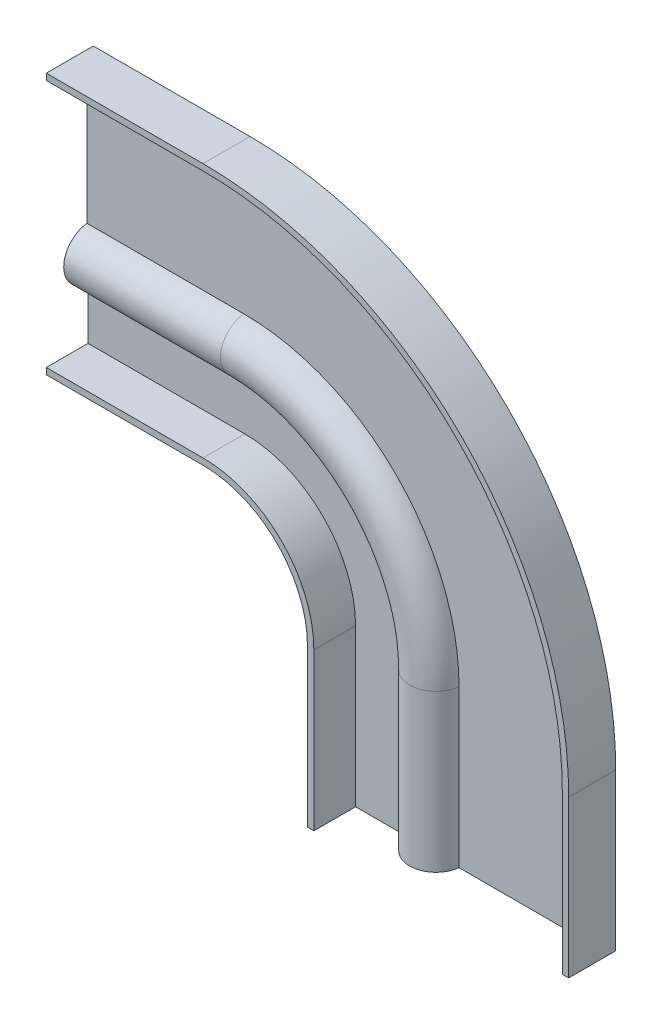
ISO-10303-21;
HEADER;
FILE_DESCRIPTION(('STEP AP214'),'2;1');
FILE_NAME('part.step','',(''),(''),'','','');
FILE_SCHEMA(('AUTOMOTIVE_DESIGN { 1 0 10303 214 1 1 1 1 }'));
ENDSEC;
DATA;
#1=APPLICATION_CONTEXT('core data for automotive mechanical design processes');
#2=APPLICATION_PROTOCOL_DEFINITION('international standard','automotive_design',2000,#1);
#3=PRODUCT_CONTEXT('',#1,'mechanical');
#4=PRODUCT('Part','Part','',(#3));
#5=PRODUCT_RELATED_PRODUCT_CATEGORY('part','',(#4));
#6=PRODUCT_DEFINITION_FORMATION('','',#4);
#7=PRODUCT_DEFINITION_CONTEXT('part definition',#1,'design');
#8=PRODUCT_DEFINITION('design','',#6,#7);
#9=PRODUCT_DEFINITION_SHAPE('','',#8);
#10=(LENGTH_UNIT() NAMED_UNIT(*) SI_UNIT(.MILLI.,.METRE.));
#11=(NAMED_UNIT(*) PLANE_ANGLE_UNIT() SI_UNIT($,.RADIAN.));
#12=(NAMED_UNIT(*) SI_UNIT($,.STERADIAN.) SOLID_ANGLE_UNIT());
#13=UNCERTAINTY_MEASURE_WITH_UNIT(LENGTH_MEASURE(1.E-05),#10,'distance_accuracy_value','');
#14=(GEOMETRIC_REPRESENTATION_CONTEXT(3) GLOBAL_UNCERTAINTY_ASSIGNED_CONTEXT((#13)) GLOBAL_UNIT_ASSIGNED_CONTEXT((#10,
#11,#12)) REPRESENTATION_CONTEXT('',''));
#15=CARTESIAN_POINT('',(0.,0.,0.));
#16=DIRECTION('',(0.,0.,1.));
#17=DIRECTION('',(1.,0.,0.));
#18=AXIS2_PLACEMENT_3D('',#15,#16,#17);
#19=CARTESIAN_POINT('',(66.214,-20.,0.617471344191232));
#20=DIRECTION('',(0.,-1.,0.));
#21=DIRECTION('',(1.,0.,0.));
#22=AXIS2_PLACEMENT_3D('',#19,#20,#21);
#23=CYLINDRICAL_SURFACE('',#22,3.83091872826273);
#24=CARTESIAN_POINT('',(66.214,-20.,0.617471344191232));
#25=DIRECTION('',(0.,1.,0.));
#26=DIRECTION('',(0.,0.,1.));
#27=AXIS2_PLACEMENT_3D('',#24,#25,#26);
#28=CIRCLE('',#27,3.83091872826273);
#29=CARTESIAN_POINT('',(62.4331710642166,-20.,0.));
#30=VERTEX_POINT('',#29);
#31=CARTESIAN_POINT('',(69.9948289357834,-20.,0.));
#32=VERTEX_POINT('',#31);
#33=EDGE_CURVE('E237',#30,#32,#28,.T.);
#34=ORIENTED_EDGE('',*,*,#33,.T.);
#35=DIRECTION('',(0.,-1.,0.));
#36=VECTOR('',#35,1.);
#37=CARTESIAN_POINT('',(69.9948289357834,-20.,0.));
#38=LINE('',#37,#36);
#39=CARTESIAN_POINT('',(69.9948289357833,-50.,0.));
#40=VERTEX_POINT('',#39);
#41=EDGE_CURVE('E327',#32,#40,#38,.T.);
#42=ORIENTED_EDGE('',*,*,#41,.T.);
#43=CARTESIAN_POINT('',(66.214,-50.,0.617471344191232));
#44=DIRECTION('',(0.,1.,0.));
#45=DIRECTION('',(0.,0.,1.));
#46=AXIS2_PLACEMENT_3D('',#43,#44,#45);
#47=CIRCLE('',#46,3.83091872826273);
#48=CARTESIAN_POINT('',(62.4331710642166,-50.,0.));
#49=VERTEX_POINT('',#48);
#50=EDGE_CURVE('E52',#49,#40,#47,.T.);
#51=ORIENTED_EDGE('',*,*,#50,.F.);
#52=DIRECTION('',(0.,-1.,0.));
#53=VECTOR('',#52,1.);
#54=CARTESIAN_POINT('',(62.4331710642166,-20.,0.));
#55=LINE('',#54,#53);
#56=EDGE_CURVE('E37',#30,#49,#55,.T.);
#57=ORIENTED_EDGE('',*,*,#56,.F.);
#58=EDGE_LOOP('',(#34,#42,#51,#57));
#59=FACE_BOUND('',#58,.T.);
#60=ADVANCED_FACE('F30',(#59),#23,.F.);
#61=CARTESIAN_POINT('',(100.,-20.,9.00000000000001));
#62=DIRECTION('',(1.,0.,0.));
#63=DIRECTION('',(0.,1.,0.));
#64=AXIS2_PLACEMENT_3D('',#61,#62,#63);
#65=PLANE('',#64);
#66=DIRECTION('',(0.,0.,1.));
#67=VECTOR('',#66,1.);
#68=CARTESIAN_POINT('',(100.,-20.,9.00000000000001));
#69=LINE('',#68,#67);
#70=CARTESIAN_POINT('',(100.,-20.,0.));
#71=VERTEX_POINT('',#70);
#72=CARTESIAN_POINT('',(100.,-20.,9.00000000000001));
#73=VERTEX_POINT('',#72);
#74=EDGE_CURVE('E234',#71,#73,#69,.T.);
#75=ORIENTED_EDGE('',*,*,#74,.T.);
#76=DIRECTION('',(0.,-1.,0.));
#77=VECTOR('',#76,1.);
#78=CARTESIAN_POINT('',(100.,-20.,9.00000000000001));
#79=LINE('',#78,#77);
#80=CARTESIAN_POINT('',(100.,-50.,9.00000000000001));
#81=VERTEX_POINT('',#80);
#82=EDGE_CURVE('E321',#73,#81,#79,.T.);
#83=ORIENTED_EDGE('',*,*,#82,.T.);
#84=DIRECTION('',(0.,0.,1.));
#85=VECTOR('',#84,1.);
#86=CARTESIAN_POINT('',(100.,-50.,9.00000000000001));
#87=LINE('',#86,#85);
#88=CARTESIAN_POINT('',(100.,-50.,0.));
#89=VERTEX_POINT('',#88);
#90=EDGE_CURVE('E292',#89,#81,#87,.T.);
#91=ORIENTED_EDGE('',*,*,#90,.F.);
#92=DIRECTION('',(0.,-1.,0.));
#93=VECTOR('',#92,1.);
#94=CARTESIAN_POINT('',(100.,-20.,0.));
#95=LINE('',#94,#93);
#96=EDGE_CURVE('E324',#71,#89,#95,.T.);
#97=ORIENTED_EDGE('',*,*,#96,.F.);
#98=EDGE_LOOP('',(#75,#83,#91,#97));
#99=FACE_BOUND('',#98,.T.);
#100=ADVANCED_FACE('F452',(#99),#65,.T.);
#101=CARTESIAN_POINT('',(98.786,-20.,9.00000000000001));
#102=DIRECTION('',(-1.,0.,0.));
#103=DIRECTION('',(0.,0.,1.));
#104=AXIS2_PLACEMENT_3D('',#101,#102,#103);
#105=PLANE('',#104);
#106=DIRECTION('',(0.,0.,-1.));
#107=VECTOR('',#106,1.);
#108=CARTESIAN_POINT('',(98.786,-20.,9.00000000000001));
#109=LINE('',#108,#107);
#110=CARTESIAN_POINT('',(98.786,-20.,9.00000000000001));
#111=VERTEX_POINT('',#110);
#112=CARTESIAN_POINT('',(98.786,-20.,1.214));
#113=VERTEX_POINT('',#112);
#114=EDGE_CURVE('E231',#111,#113,#109,.T.);
#115=ORIENTED_EDGE('',*,*,#114,.T.);
#116=DIRECTION('',(0.,-1.,0.));
#117=VECTOR('',#116,1.);
#118=CARTESIAN_POINT('',(98.786,-20.,1.214));
#119=LINE('',#118,#117);
#120=CARTESIAN_POINT('',(98.786,-50.,1.214));
#121=VERTEX_POINT('',#120);
#122=EDGE_CURVE('E315',#113,#121,#119,.T.);
#123=ORIENTED_EDGE('',*,*,#122,.T.);
#124=DIRECTION('',(0.,0.,-1.));
#125=VECTOR('',#124,1.);
#126=CARTESIAN_POINT('',(98.786,-50.,9.00000000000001));
#127=LINE('',#126,#125);
#128=CARTESIAN_POINT('',(98.786,-50.,9.00000000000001));
#129=VERTEX_POINT('',#128);
#130=EDGE_CURVE('E286',#129,#121,#127,.T.);
#131=ORIENTED_EDGE('',*,*,#130,.F.);
#132=DIRECTION('',(0.,-1.,0.));
#133=VECTOR('',#132,1.);
#134=CARTESIAN_POINT('',(98.786,-20.,9.00000000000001));
#135=LINE('',#134,#133);
#136=EDGE_CURVE('E318',#111,#129,#135,.T.);
#137=ORIENTED_EDGE('',*,*,#136,.F.);
#138=EDGE_LOOP('',(#115,#123,#131,#137));
#139=FACE_BOUND('',#138,.T.);
#140=ADVANCED_FACE('F455',(#139),#105,.T.);
#141=CARTESIAN_POINT('',(66.214,-20.,0.617471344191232));
#142=DIRECTION('',(0.,-1.,0.));
#143=DIRECTION('',(1.,0.,0.));
#144=AXIS2_PLACEMENT_3D('',#141,#142,#143);
#145=CYLINDRICAL_SURFACE('',#144,5.04491872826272);
#146=CARTESIAN_POINT('',(66.214,-20.,0.617471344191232));
#147=DIRECTION('',(0.,-1.,0.));
#148=DIRECTION('',(0.,0.,-1.));
#149=AXIS2_PLACEMENT_3D('',#146,#147,#148);
#150=CIRCLE('',#149,5.04491872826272);
#151=CARTESIAN_POINT('',(71.223526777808,-20.,1.214));
#152=VERTEX_POINT('',#151);
#153=CARTESIAN_POINT('',(61.1847097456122,-20.,1.01426412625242));
#154=VERTEX_POINT('',#153);
#155=EDGE_CURVE('E228',#152,#154,#150,.T.);
#156=ORIENTED_EDGE('',*,*,#155,.T.);
#157=DIRECTION('',(0.,-1.,0.));
#158=VECTOR('',#157,1.);
#159=CARTESIAN_POINT('',(61.1847097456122,-20.,1.01426412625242));
#160=LINE('',#159,#158);
#161=CARTESIAN_POINT('',(61.1847097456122,-50.,1.01426412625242));
#162=VERTEX_POINT('',#161);
#163=EDGE_CURVE('E309',#154,#162,#160,.T.);
#164=ORIENTED_EDGE('',*,*,#163,.T.);
#165=CARTESIAN_POINT('',(66.214,-50.,0.617471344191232));
#166=DIRECTION('',(0.,-1.,0.));
#167=DIRECTION('',(0.,0.,-1.));
#168=AXIS2_PLACEMENT_3D('',#165,#166,#167);
#169=CIRCLE('',#168,5.04491872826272);
#170=CARTESIAN_POINT('',(71.223526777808,-50.,1.214));
#171=VERTEX_POINT('',#170);
#172=EDGE_CURVE('E280',#171,#162,#169,.T.);
#173=ORIENTED_EDGE('',*,*,#172,.F.);
#174=DIRECTION('',(0.,-1.,0.));
#175=VECTOR('',#174,1.);
#176=CARTESIAN_POINT('',(71.223526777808,-20.,1.214));
#177=LINE('',#176,#175);
#178=EDGE_CURVE('E312',#152,#171,#177,.T.);
#179=ORIENTED_EDGE('',*,*,#178,.F.);
#180=EDGE_LOOP('',(#156,#164,#173,#179));
#181=FACE_BOUND('',#180,.T.);
#182=ADVANCED_FACE('F474',(#181),#145,.T.);
#183=CARTESIAN_POINT('',(51.214,-20.,1.01426412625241));
#184=DIRECTION('',(1.,0.,0.));
#185=DIRECTION('',(0.,1.,0.));
#186=AXIS2_PLACEMENT_3D('',#183,#184,#185);
#187=PLANE('',#186);
#188=DIRECTION('',(0.,0.,1.));
#189=VECTOR('',#188,1.);
#190=CARTESIAN_POINT('',(51.214,-20.,1.01426412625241));
#191=LINE('',#190,#189);
#192=CARTESIAN_POINT('',(51.214,-20.,1.01426412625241));
#193=VERTEX_POINT('',#192);
#194=CARTESIAN_POINT('',(51.214,-20.,9.));
#195=VERTEX_POINT('',#194);
#196=EDGE_CURVE('E219',#193,#195,#191,.T.);
#197=ORIENTED_EDGE('',*,*,#196,.T.);
#198=DIRECTION('',(0.,-1.,0.));
#199=VECTOR('',#198,1.);
#200=CARTESIAN_POINT('',(51.214,-20.,9.));
#201=LINE('',#200,#199);
#202=CARTESIAN_POINT('',(51.214,-50.,9.));
#203=VERTEX_POINT('',#202);
#204=EDGE_CURVE('E303',#195,#203,#201,.T.);
#205=ORIENTED_EDGE('',*,*,#204,.T.);
#206=DIRECTION('',(0.,0.,1.));
#207=VECTOR('',#206,1.);
#208=CARTESIAN_POINT('',(51.214,-50.,1.01426412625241));
#209=LINE('',#208,#207);
#210=CARTESIAN_POINT('',(51.214,-50.,1.01426412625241));
#211=VERTEX_POINT('',#210);
#212=EDGE_CURVE('E274',#211,#203,#209,.T.);
#213=ORIENTED_EDGE('',*,*,#212,.F.);
#214=DIRECTION('',(0.,-1.,0.));
#215=VECTOR('',#214,1.);
#216=CARTESIAN_POINT('',(51.214,-20.,1.01426412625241));
#217=LINE('',#216,#215);
#218=EDGE_CURVE('E306',#193,#211,#217,.T.);
#219=ORIENTED_EDGE('',*,*,#218,.F.);
#220=EDGE_LOOP('',(#197,#205,#213,#219));
#221=FACE_BOUND('',#220,.T.);
#222=ADVANCED_FACE('F479',(#221),#187,.T.);
#223=CARTESIAN_POINT('',(50.,-20.,9.));
#224=DIRECTION('',(-1.,0.,0.));
#225=DIRECTION('',(0.,-1.,0.));
#226=AXIS2_PLACEMENT_3D('',#223,#224,#225);
#227=PLANE('',#226);
#228=DIRECTION('',(0.,0.,-1.));
#229=VECTOR('',#228,1.);
#230=CARTESIAN_POINT('',(50.,-20.,9.));
#231=LINE('',#230,#229);
#232=CARTESIAN_POINT('',(50.,-20.,9.));
#233=VERTEX_POINT('',#232);
#234=CARTESIAN_POINT('',(50.,-20.,0.));
#235=VERTEX_POINT('',#234);
#236=EDGE_CURVE('E216',#233,#235,#231,.T.);
#237=ORIENTED_EDGE('',*,*,#236,.T.);
#238=DIRECTION('',(0.,-1.,0.));
#239=VECTOR('',#238,1.);
#240=CARTESIAN_POINT('',(50.,-20.,0.));
#241=LINE('',#240,#239);
#242=CARTESIAN_POINT('',(50.,-50.,0.));
#243=VERTEX_POINT('',#242);
#244=EDGE_CURVE('E11',#235,#243,#241,.T.);
#245=ORIENTED_EDGE('',*,*,#244,.T.);
#246=DIRECTION('',(0.,0.,-1.));
#247=VECTOR('',#246,1.);
#248=CARTESIAN_POINT('',(50.,-50.,9.));
#249=LINE('',#248,#247);
#250=CARTESIAN_POINT('',(50.,-50.,9.));
#251=VERTEX_POINT('',#250);
#252=EDGE_CURVE('E199',#251,#243,#249,.T.);
#253=ORIENTED_EDGE('',*,*,#252,.F.);
#254=DIRECTION('',(0.,-1.,0.));
#255=VECTOR('',#254,1.);
#256=CARTESIAN_POINT('',(50.,-20.,9.));
#257=LINE('',#256,#255);
#258=EDGE_CURVE('E300',#233,#251,#257,.T.);
#259=ORIENTED_EDGE('',*,*,#258,.F.);
#260=EDGE_LOOP('',(#237,#245,#253,#259));
#261=FACE_BOUND('',#260,.T.);
#262=ADVANCED_FACE('F342',(#261),#227,.T.);
#263=CARTESIAN_POINT('',(30.,-20.,0.617471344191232));
#264=DIRECTION('',(0.,0.,-1.));
#265=DIRECTION('',(-1.,0.,0.));
#266=AXIS2_PLACEMENT_3D('',#263,#264,#265);
#267=TOROIDAL_SURFACE('',#266,36.214,3.83091872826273);
#268=CARTESIAN_POINT('',(30.,16.214,0.617471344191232));
#269=DIRECTION('',(-1.,0.,0.));
#270=DIRECTION('',(0.,0.,1.));
#271=AXIS2_PLACEMENT_3D('',#268,#269,#270);
#272=CIRCLE('',#271,3.83091872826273);
#273=CARTESIAN_POINT('',(30.,12.4331710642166,0.));
#274=VERTEX_POINT('',#273);
#275=CARTESIAN_POINT('',(30.,19.9948289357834,0.));
#276=VERTEX_POINT('',#275);
#277=EDGE_CURVE('E210',#274,#276,#272,.T.);
#278=ORIENTED_EDGE('',*,*,#277,.T.);
#279=CARTESIAN_POINT('',(30.,-20.,0.));
#280=DIRECTION('',(0.,0.,-1.));
#281=DIRECTION('',(-1.,0.,0.));
#282=AXIS2_PLACEMENT_3D('',#279,#280,#281);
#283=CIRCLE('',#282,39.9948289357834);
#284=EDGE_CURVE('E265',#276,#32,#283,.T.);
#285=ORIENTED_EDGE('',*,*,#284,.T.);
#286=ORIENTED_EDGE('',*,*,#33,.F.);
#287=CARTESIAN_POINT('',(30.,-20.,0.));
#288=DIRECTION('',(0.,0.,-1.));
#289=DIRECTION('',(-1.,0.,0.));
#290=AXIS2_PLACEMENT_3D('',#287,#288,#289);
#291=CIRCLE('',#290,32.4331710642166);
#292=EDGE_CURVE('E200',#274,#30,#291,.T.);
#293=ORIENTED_EDGE('',*,*,#292,.F.);
#294=EDGE_LOOP('',(#278,#285,#286,#293));
#295=FACE_BOUND('',#294,.T.);
#296=ADVANCED_FACE('F332',(#295),#267,.F.);
#297=CARTESIAN_POINT('',(30.,-20.,0.));
#298=DIRECTION('',(0.,0.,-1.));
#299=DIRECTION('',(-1.,0.,0.));
#300=AXIS2_PLACEMENT_3D('',#297,#298,#299);
#301=CYLINDRICAL_SURFACE('',#300,70.);
#302=DIRECTION('',(0.,0.,1.));
#303=VECTOR('',#302,1.);
#304=CARTESIAN_POINT('',(30.,50.,9.00000000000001));
#305=LINE('',#304,#303);
#306=CARTESIAN_POINT('',(30.,50.,0.));
#307=VERTEX_POINT('',#306);
#308=CARTESIAN_POINT('',(30.,50.,9.00000000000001));
#309=VERTEX_POINT('',#308);
#310=EDGE_CURVE('E386',#307,#309,#305,.T.);
#311=ORIENTED_EDGE('',*,*,#310,.T.);
#312=CARTESIAN_POINT('',(30.,-20.,9.00000000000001));
#313=DIRECTION('',(0.,0.,-1.));
#314=DIRECTION('',(-1.,0.,0.));
#315=AXIS2_PLACEMENT_3D('',#312,#313,#314);
#316=CIRCLE('',#315,70.);
#317=EDGE_CURVE('E259',#309,#73,#316,.T.);
#318=ORIENTED_EDGE('',*,*,#317,.T.);
#319=ORIENTED_EDGE('',*,*,#74,.F.);
#320=CARTESIAN_POINT('',(30.,-20.,0.));
#321=DIRECTION('',(0.,0.,-1.));
#322=DIRECTION('',(-1.,0.,0.));
#323=AXIS2_PLACEMENT_3D('',#320,#321,#322);
#324=CIRCLE('',#323,70.);
#325=EDGE_CURVE('E262',#307,#71,#324,.T.);
#326=ORIENTED_EDGE('',*,*,#325,.F.);
#327=EDGE_LOOP('',(#311,#318,#319,#326));
#328=FACE_BOUND('',#327,.T.);
#329=ADVANCED_FACE('F450',(#328),#301,.T.);
#330=CARTESIAN_POINT('',(30.,-20.,0.));
#331=DIRECTION('',(0.,0.,-1.));
#332=DIRECTION('',(-1.,0.,0.));
#333=AXIS2_PLACEMENT_3D('',#330,#331,#332);
#334=CYLINDRICAL_SURFACE('',#333,68.786);
#335=DIRECTION('',(0.,0.,-1.));
#336=VECTOR('',#335,1.);
#337=CARTESIAN_POINT('',(30.,48.786,9.00000000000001));
#338=LINE('',#337,#336);
#339=CARTESIAN_POINT('',(30.,48.786,9.00000000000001));
#340=VERTEX_POINT('',#339);
#341=CARTESIAN_POINT('',(30.,48.786,1.214));
#342=VERTEX_POINT('',#341);
#343=EDGE_CURVE('E422',#340,#342,#338,.T.);
#344=ORIENTED_EDGE('',*,*,#343,.T.);
#345=CARTESIAN_POINT('',(30.,-20.,1.214));
#346=DIRECTION('',(0.,0.,-1.));
#347=DIRECTION('',(-1.,0.,0.));
#348=AXIS2_PLACEMENT_3D('',#345,#346,#347);
#349=CIRCLE('',#348,68.786);
#350=EDGE_CURVE('E253',#342,#113,#349,.T.);
#351=ORIENTED_EDGE('',*,*,#350,.T.);
#352=ORIENTED_EDGE('',*,*,#114,.F.);
#353=CARTESIAN_POINT('',(30.,-20.,9.00000000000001));
#354=DIRECTION('',(0.,0.,-1.));
#355=DIRECTION('',(-1.,0.,0.));
#356=AXIS2_PLACEMENT_3D('',#353,#354,#355);
#357=CIRCLE('',#356,68.786);
#358=EDGE_CURVE('E256',#340,#111,#357,.T.);
#359=ORIENTED_EDGE('',*,*,#358,.F.);
#360=EDGE_LOOP('',(#344,#351,#352,#359));
#361=FACE_BOUND('',#360,.T.);
#362=ADVANCED_FACE('F457',(#361),#334,.F.);
#363=CARTESIAN_POINT('',(30.,-20.,0.617471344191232));
#364=DIRECTION('',(0.,0.,-1.));
#365=DIRECTION('',(-1.,0.,0.));
#366=AXIS2_PLACEMENT_3D('',#363,#364,#365);
#367=TOROIDAL_SURFACE('',#366,36.214,5.04491872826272);
#368=CARTESIAN_POINT('',(30.,16.214,0.617471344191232));
#369=DIRECTION('',(1.,0.,0.));
#370=DIRECTION('',(0.,0.,-1.));
#371=AXIS2_PLACEMENT_3D('',#368,#369,#370);
#372=CIRCLE('',#371,5.04491872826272);
#373=CARTESIAN_POINT('',(30.,21.223526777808,1.214));
#374=VERTEX_POINT('',#373);
#375=CARTESIAN_POINT('',(30.,11.1847097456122,1.01426412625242));
#376=VERTEX_POINT('',#375);
#377=EDGE_CURVE('E354',#374,#376,#372,.T.);
#378=ORIENTED_EDGE('',*,*,#377,.T.);
#379=CARTESIAN_POINT('',(30.,-20.,1.01426412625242));
#380=DIRECTION('',(0.,0.,-1.));
#381=DIRECTION('',(-1.,0.,0.));
#382=AXIS2_PLACEMENT_3D('',#379,#380,#381);
#383=CIRCLE('',#382,31.1847097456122);
#384=EDGE_CURVE('E247',#376,#154,#383,.T.);
#385=ORIENTED_EDGE('',*,*,#384,.T.);
#386=ORIENTED_EDGE('',*,*,#155,.F.);
#387=CARTESIAN_POINT('',(30.,-20.,1.214));
#388=DIRECTION('',(0.,0.,-1.));
#389=DIRECTION('',(-1.,0.,0.));
#390=AXIS2_PLACEMENT_3D('',#387,#388,#389);
#391=CIRCLE('',#390,41.223526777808);
#392=EDGE_CURVE('E250',#374,#152,#391,.T.);
#393=ORIENTED_EDGE('',*,*,#392,.F.);
#394=EDGE_LOOP('',(#378,#385,#386,#393));
#395=FACE_BOUND('',#394,.T.);
#396=ADVANCED_FACE('F430',(#395),#367,.T.);
#397=CARTESIAN_POINT('',(30.,-20.,0.));
#398=DIRECTION('',(0.,0.,-1.));
#399=DIRECTION('',(-1.,0.,0.));
#400=AXIS2_PLACEMENT_3D('',#397,#398,#399);
#401=CYLINDRICAL_SURFACE('',#400,21.214);
#402=DIRECTION('',(0.,0.,1.));
#403=VECTOR('',#402,1.);
#404=CARTESIAN_POINT('',(30.,1.214,1.01426412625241));
#405=LINE('',#404,#403);
#406=CARTESIAN_POINT('',(30.,1.214,1.01426412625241));
#407=VERTEX_POINT('',#406);
#408=CARTESIAN_POINT('',(30.,1.214,9.));
#409=VERTEX_POINT('',#408);
#410=EDGE_CURVE('E349',#407,#409,#405,.T.);
#411=ORIENTED_EDGE('',*,*,#410,.T.);
#412=CARTESIAN_POINT('',(30.,-20.,9.));
#413=DIRECTION('',(0.,0.,-1.));
#414=DIRECTION('',(-1.,0.,0.));
#415=AXIS2_PLACEMENT_3D('',#412,#413,#414);
#416=CIRCLE('',#415,21.214);
#417=EDGE_CURVE('E241',#409,#195,#416,.T.);
#418=ORIENTED_EDGE('',*,*,#417,.T.);
#419=ORIENTED_EDGE('',*,*,#196,.F.);
#420=CARTESIAN_POINT('',(30.,-20.,1.01426412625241));
#421=DIRECTION('',(0.,0.,-1.));
#422=DIRECTION('',(-1.,0.,0.));
#423=AXIS2_PLACEMENT_3D('',#420,#421,#422);
#424=CIRCLE('',#423,21.214);
#425=EDGE_CURVE('E244',#407,#193,#424,.T.);
#426=ORIENTED_EDGE('',*,*,#425,.F.);
#427=EDGE_LOOP('',(#411,#418,#419,#426));
#428=FACE_BOUND('',#427,.T.);
#429=ADVANCED_FACE('F464',(#428),#401,.T.);
#430=CARTESIAN_POINT('',(30.,-20.,0.));
#431=DIRECTION('',(0.,0.,-1.));
#432=DIRECTION('',(-1.,0.,0.));
#433=AXIS2_PLACEMENT_3D('',#430,#431,#432);
#434=CYLINDRICAL_SURFACE('',#433,20.);
#435=DIRECTION('',(0.,0.,-1.));
#436=VECTOR('',#435,1.);
#437=CARTESIAN_POINT('',(30.,0.,9.));
#438=LINE('',#437,#436);
#439=CARTESIAN_POINT('',(30.,0.,9.));
#440=VERTEX_POINT('',#439);
#441=CARTESIAN_POINT('',(30.,0.,0.));
#442=VERTEX_POINT('',#441);
#443=EDGE_CURVE('E203',#440,#442,#438,.T.);
#444=ORIENTED_EDGE('',*,*,#443,.T.);
#445=CARTESIAN_POINT('',(30.,-20.,0.));
#446=DIRECTION('',(0.,0.,-1.));
#447=DIRECTION('',(-1.,0.,0.));
#448=AXIS2_PLACEMENT_3D('',#445,#446,#447);
#449=CIRCLE('',#448,20.);
#450=EDGE_CURVE('E190',#442,#235,#449,.T.);
#451=ORIENTED_EDGE('',*,*,#450,.T.);
#452=ORIENTED_EDGE('',*,*,#236,.F.);
#453=CARTESIAN_POINT('',(30.,-20.,9.));
#454=DIRECTION('',(0.,0.,-1.));
#455=DIRECTION('',(-1.,0.,0.));
#456=AXIS2_PLACEMENT_3D('',#453,#454,#455);
#457=CIRCLE('',#456,20.);
#458=EDGE_CURVE('E206',#440,#233,#457,.T.);
#459=ORIENTED_EDGE('',*,*,#458,.F.);
#460=EDGE_LOOP('',(#444,#451,#452,#459));
#461=FACE_BOUND('',#460,.T.);
#462=ADVANCED_FACE('F204',(#461),#434,.F.);
#463=CARTESIAN_POINT('',(30.,0.,9.));
#464=DIRECTION('',(0.,1.,0.));
#465=DIRECTION('',(-1.,0.,0.));
#466=AXIS2_PLACEMENT_3D('',#463,#464,#465);
#467=PLANE('',#466);
#468=DIRECTION('',(0.,0.,-1.));
#469=VECTOR('',#468,1.);
#470=CARTESIAN_POINT('',(0.,0.,9.));
#471=LINE('',#470,#469);
#472=CARTESIAN_POINT('',(0.,0.,9.));
#473=VERTEX_POINT('',#472);
#474=CARTESIAN_POINT('',(0.,0.,0.));
#475=VERTEX_POINT('',#474);
#476=EDGE_CURVE('E215',#473,#475,#471,.T.);
#477=ORIENTED_EDGE('',*,*,#476,.T.);
#478=DIRECTION('',(-1.,0.,0.));
#479=VECTOR('',#478,1.);
#480=CARTESIAN_POINT('',(30.,0.,0.));
#481=LINE('',#480,#479);
#482=EDGE_CURVE('E194',#442,#475,#481,.T.);
#483=ORIENTED_EDGE('',*,*,#482,.F.);
#484=ORIENTED_EDGE('',*,*,#443,.F.);
#485=DIRECTION('',(-1.,0.,0.));
#486=VECTOR('',#485,1.);
#487=CARTESIAN_POINT('',(30.,0.,9.));
#488=LINE('',#487,#486);
#489=EDGE_CURVE('E345',#440,#473,#488,.T.);
#490=ORIENTED_EDGE('',*,*,#489,.T.);
#491=EDGE_LOOP('',(#477,#483,#484,#490));
#492=FACE_BOUND('',#491,.T.);
#493=ADVANCED_FACE('F213',(#492),#467,.F.);
#494=CARTESIAN_POINT('',(30.,0.,0.));
#495=DIRECTION('',(0.,0.,1.));
#496=DIRECTION('',(0.,-1.,0.));
#497=AXIS2_PLACEMENT_3D('',#494,#495,#496);
#498=PLANE('',#497);
#499=DIRECTION('',(0.,1.,0.));
#500=VECTOR('',#499,1.);
#501=CARTESIAN_POINT('',(0.,0.,0.));
#502=LINE('',#501,#500);
#503=CARTESIAN_POINT('',(0.,12.4331710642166,0.));
#504=VERTEX_POINT('',#503);
#505=EDGE_CURVE('E415',#475,#504,#502,.T.);
#506=ORIENTED_EDGE('',*,*,#505,.T.);
#507=DIRECTION('',(-1.,0.,0.));
#508=VECTOR('',#507,1.);
#509=CARTESIAN_POINT('',(30.,12.4331710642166,0.));
#510=LINE('',#509,#508);
#511=EDGE_CURVE('E217',#274,#504,#510,.T.);
#512=ORIENTED_EDGE('',*,*,#511,.F.);
#513=ORIENTED_EDGE('',*,*,#292,.T.);
#514=ORIENTED_EDGE('',*,*,#56,.T.);
#515=DIRECTION('',(1.,0.,0.));
#516=VECTOR('',#515,1.);
#517=CARTESIAN_POINT('',(50.,-50.,0.));
#518=LINE('',#517,#516);
#519=EDGE_CURVE('E44',#243,#49,#518,.T.);
#520=ORIENTED_EDGE('',*,*,#519,.F.);
#521=ORIENTED_EDGE('',*,*,#244,.F.);
#522=ORIENTED_EDGE('',*,*,#450,.F.);
#523=ORIENTED_EDGE('',*,*,#482,.T.);
#524=EDGE_LOOP('',(#506,#512,#513,#514,#520,#521,#522,#523));
#525=FACE_BOUND('',#524,.T.);
#526=ADVANCED_FACE('F192',(#525),#498,.F.);
#527=CARTESIAN_POINT('',(30.,16.214,0.617471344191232));
#528=DIRECTION('',(-1.,0.,0.));
#529=DIRECTION('',(0.,-1.,0.));
#530=AXIS2_PLACEMENT_3D('',#527,#528,#529);
#531=CYLINDRICAL_SURFACE('',#530,3.83091872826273);
#532=CARTESIAN_POINT('',(0.,16.214,0.617471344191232));
#533=DIRECTION('',(-1.,0.,0.));
#534=DIRECTION('',(0.,0.,1.));
#535=AXIS2_PLACEMENT_3D('',#532,#533,#534);
#536=CIRCLE('',#535,3.83091872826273);
#537=CARTESIAN_POINT('',(0.,19.9948289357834,0.));
#538=VERTEX_POINT('',#537);
#539=EDGE_CURVE('E397',#504,#538,#536,.T.);
#540=ORIENTED_EDGE('',*,*,#539,.T.);
#541=DIRECTION('',(-1.,0.,0.));
#542=VECTOR('',#541,1.);
#543=CARTESIAN_POINT('',(30.,19.9948289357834,0.));
#544=LINE('',#543,#542);
#545=EDGE_CURVE('E222',#276,#538,#544,.T.);
#546=ORIENTED_EDGE('',*,*,#545,.F.);
#547=ORIENTED_EDGE('',*,*,#277,.F.);
#548=ORIENTED_EDGE('',*,*,#511,.T.);
#549=EDGE_LOOP('',(#540,#546,#547,#548));
#550=FACE_BOUND('',#549,.T.);
#551=ADVANCED_FACE('F420',(#550),#531,.F.);
#552=CARTESIAN_POINT('',(30.,19.9948289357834,0.));
#553=DIRECTION('',(0.,0.,1.));
#554=DIRECTION('',(1.,0.,0.));
#555=AXIS2_PLACEMENT_3D('',#552,#553,#554);
#556=PLANE('',#555);
#557=DIRECTION('',(0.,1.,0.));
#558=VECTOR('',#557,1.);
#559=CARTESIAN_POINT('',(0.,19.9948289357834,0.));
#560=LINE('',#559,#558);
#561=CARTESIAN_POINT('',(0.,50.,0.));
#562=VERTEX_POINT('',#561);
#563=EDGE_CURVE('E391',#538,#562,#560,.T.);
#564=ORIENTED_EDGE('',*,*,#563,.T.);
#565=DIRECTION('',(-1.,0.,0.));
#566=VECTOR('',#565,1.);
#567=CARTESIAN_POINT('',(30.,50.,0.));
#568=LINE('',#567,#566);
#569=EDGE_CURVE('E376',#307,#562,#568,.T.);
#570=ORIENTED_EDGE('',*,*,#569,.F.);
#571=ORIENTED_EDGE('',*,*,#325,.T.);
#572=ORIENTED_EDGE('',*,*,#96,.T.);
#573=DIRECTION('',(1.,0.,0.));
#574=VECTOR('',#573,1.);
#575=CARTESIAN_POINT('',(69.9948289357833,-50.,0.));
#576=LINE('',#575,#574);
#577=EDGE_CURVE('E295',#40,#89,#576,.T.);
#578=ORIENTED_EDGE('',*,*,#577,.F.);
#579=ORIENTED_EDGE('',*,*,#41,.F.);
#580=ORIENTED_EDGE('',*,*,#284,.F.);
#581=ORIENTED_EDGE('',*,*,#545,.T.);
#582=EDGE_LOOP('',(#564,#570,#571,#572,#578,#579,#580,#581));
#583=FACE_BOUND('',#582,.T.);
#584=ADVANCED_FACE('F337',(#583),#556,.F.);
#585=CARTESIAN_POINT('',(30.,50.,9.00000000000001));
#586=DIRECTION('',(0.,-1.,0.));
#587=DIRECTION('',(1.,0.,0.));
#588=AXIS2_PLACEMENT_3D('',#585,#586,#587);
#589=PLANE('',#588);
#590=DIRECTION('',(0.,0.,1.));
#591=VECTOR('',#590,1.);
#592=CARTESIAN_POINT('',(0.,50.,9.00000000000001));
#593=LINE('',#592,#591);
#594=CARTESIAN_POINT('',(0.,50.,9.00000000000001));
#595=VERTEX_POINT('',#594);
#596=EDGE_CURVE('E384',#562,#595,#593,.T.);
#597=ORIENTED_EDGE('',*,*,#596,.T.);
#598=DIRECTION('',(-1.,0.,0.));
#599=VECTOR('',#598,1.);
#600=CARTESIAN_POINT('',(30.,50.,9.00000000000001));
#601=LINE('',#600,#599);
#602=EDGE_CURVE('E373',#309,#595,#601,.T.);
#603=ORIENTED_EDGE('',*,*,#602,.F.);
#604=ORIENTED_EDGE('',*,*,#310,.F.);
#605=ORIENTED_EDGE('',*,*,#569,.T.);
#606=EDGE_LOOP('',(#597,#603,#604,#605));
#607=FACE_BOUND('',#606,.T.);
#608=ADVANCED_FACE('F382',(#607),#589,.F.);
#609=CARTESIAN_POINT('',(30.,50.,9.00000000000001));
#610=DIRECTION('',(0.,0.,-1.));
#611=DIRECTION('',(-1.,0.,0.));
#612=AXIS2_PLACEMENT_3D('',#609,#610,#611);
#613=PLANE('',#612);
#614=DIRECTION('',(0.,-1.,0.));
#615=VECTOR('',#614,1.);
#616=CARTESIAN_POINT('',(0.,50.,9.00000000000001));
#617=LINE('',#616,#615);
#618=CARTESIAN_POINT('',(0.,48.786,9.00000000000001));
#619=VERTEX_POINT('',#618);
#620=EDGE_CURVE('E393',#595,#619,#617,.T.);
#621=ORIENTED_EDGE('',*,*,#620,.T.);
#622=DIRECTION('',(-1.,0.,0.));
#623=VECTOR('',#622,1.);
#624=CARTESIAN_POINT('',(30.,48.786,9.00000000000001));
#625=LINE('',#624,#623);
#626=EDGE_CURVE('E370',#340,#619,#625,.T.);
#627=ORIENTED_EDGE('',*,*,#626,.F.);
#628=ORIENTED_EDGE('',*,*,#358,.T.);
#629=ORIENTED_EDGE('',*,*,#136,.T.);
#630=DIRECTION('',(-1.,0.,0.));
#631=VECTOR('',#630,1.);
#632=CARTESIAN_POINT('',(100.,-50.,9.00000000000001));
#633=LINE('',#632,#631);
#634=EDGE_CURVE('E289',#81,#129,#633,.T.);
#635=ORIENTED_EDGE('',*,*,#634,.F.);
#636=ORIENTED_EDGE('',*,*,#82,.F.);
#637=ORIENTED_EDGE('',*,*,#317,.F.);
#638=ORIENTED_EDGE('',*,*,#602,.T.);
#639=EDGE_LOOP('',(#621,#627,#628,#629,#635,#636,#637,#638));
#640=FACE_BOUND('',#639,.T.);
#641=ADVANCED_FACE('F447',(#640),#613,.F.);
#642=CARTESIAN_POINT('',(30.,48.786,9.00000000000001));
#643=DIRECTION('',(0.,1.,0.));
#644=DIRECTION('',(0.,0.,1.));
#645=AXIS2_PLACEMENT_3D('',#642,#643,#644);
#646=PLANE('',#645);
#647=DIRECTION('',(0.,0.,-1.));
#648=VECTOR('',#647,1.);
#649=CARTESIAN_POINT('',(0.,48.786,9.00000000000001));
#650=LINE('',#649,#648);
#651=CARTESIAN_POINT('',(0.,48.786,1.214));
#652=VERTEX_POINT('',#651);
#653=EDGE_CURVE('E395',#619,#652,#650,.T.);
#654=ORIENTED_EDGE('',*,*,#653,.T.);
#655=DIRECTION('',(-1.,0.,0.));
#656=VECTOR('',#655,1.);
#657=CARTESIAN_POINT('',(30.,48.786,1.214));
#658=LINE('',#657,#656);
#659=EDGE_CURVE('E367',#342,#652,#658,.T.);
#660=ORIENTED_EDGE('',*,*,#659,.F.);
#661=ORIENTED_EDGE('',*,*,#343,.F.);
#662=ORIENTED_EDGE('',*,*,#626,.T.);
#663=EDGE_LOOP('',(#654,#660,#661,#662));
#664=FACE_BOUND('',#663,.T.);
#665=ADVANCED_FACE('F444',(#664),#646,.F.);
#666=CARTESIAN_POINT('',(30.,48.786,1.214));
#667=DIRECTION('',(0.,0.,-1.));
#668=DIRECTION('',(0.,1.,0.));
#669=AXIS2_PLACEMENT_3D('',#666,#667,#668);
#670=PLANE('',#669);
#671=DIRECTION('',(0.,-1.,0.));
#672=VECTOR('',#671,1.);
#673=CARTESIAN_POINT('',(0.,48.786,1.214));
#674=LINE('',#673,#672);
#675=CARTESIAN_POINT('',(0.,21.223526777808,1.214));
#676=VERTEX_POINT('',#675);
#677=EDGE_CURVE('E402',#652,#676,#674,.T.);
#678=ORIENTED_EDGE('',*,*,#677,.T.);
#679=DIRECTION('',(-1.,0.,0.));
#680=VECTOR('',#679,1.);
#681=CARTESIAN_POINT('',(30.,21.223526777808,1.214));
#682=LINE('',#681,#680);
#683=EDGE_CURVE('E364',#374,#676,#682,.T.);
#684=ORIENTED_EDGE('',*,*,#683,.F.);
#685=ORIENTED_EDGE('',*,*,#392,.T.);
#686=ORIENTED_EDGE('',*,*,#178,.T.);
#687=DIRECTION('',(-1.,0.,0.));
#688=VECTOR('',#687,1.);
#689=CARTESIAN_POINT('',(98.786,-50.,1.214));
#690=LINE('',#689,#688);
#691=EDGE_CURVE('E283',#121,#171,#690,.T.);
#692=ORIENTED_EDGE('',*,*,#691,.F.);
#693=ORIENTED_EDGE('',*,*,#122,.F.);
#694=ORIENTED_EDGE('',*,*,#350,.F.);
#695=ORIENTED_EDGE('',*,*,#659,.T.);
#696=EDGE_LOOP('',(#678,#684,#685,#686,#692,#693,#694,#695));
#697=FACE_BOUND('',#696,.T.);
#698=ADVANCED_FACE('F440',(#697),#670,.F.);
#699=CARTESIAN_POINT('',(30.,16.214,0.617471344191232));
#700=DIRECTION('',(-1.,0.,0.));
#701=DIRECTION('',(0.,-1.,0.));
#702=AXIS2_PLACEMENT_3D('',#699,#700,#701);
#703=CYLINDRICAL_SURFACE('',#702,5.04491872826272);
#704=CARTESIAN_POINT('',(0.,16.214,0.617471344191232));
#705=DIRECTION('',(1.,0.,0.));
#706=DIRECTION('',(0.,0.,-1.));
#707=AXIS2_PLACEMENT_3D('',#704,#705,#706);
#708=CIRCLE('',#707,5.04491872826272);
#709=CARTESIAN_POINT('',(0.,11.1847097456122,1.01426412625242));
#710=VERTEX_POINT('',#709);
#711=EDGE_CURVE('E404',#676,#710,#708,.T.);
#712=ORIENTED_EDGE('',*,*,#711,.T.);
#713=DIRECTION('',(-1.,0.,0.));
#714=VECTOR('',#713,1.);
#715=CARTESIAN_POINT('',(30.,11.1847097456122,1.01426412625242));
#716=LINE('',#715,#714);
#717=EDGE_CURVE('E361',#376,#710,#716,.T.);
#718=ORIENTED_EDGE('',*,*,#717,.F.);
#719=ORIENTED_EDGE('',*,*,#377,.F.);
#720=ORIENTED_EDGE('',*,*,#683,.T.);
#721=EDGE_LOOP('',(#712,#718,#719,#720));
#722=FACE_BOUND('',#721,.T.);
#723=ADVANCED_FACE('F434',(#722),#703,.T.);
#724=CARTESIAN_POINT('',(30.,11.1847097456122,1.01426412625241));
#725=DIRECTION('',(0.,0.,-1.));
#726=DIRECTION('',(-1.,0.,0.));
#727=AXIS2_PLACEMENT_3D('',#724,#725,#726);
#728=PLANE('',#727);
#729=DIRECTION('',(0.,-1.,0.));
#730=VECTOR('',#729,1.);
#731=CARTESIAN_POINT('',(0.,11.1847097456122,1.01426412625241));
#732=LINE('',#731,#730);
#733=CARTESIAN_POINT('',(0.,1.214,1.01426412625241));
#734=VERTEX_POINT('',#733);
#735=EDGE_CURVE('E406',#710,#734,#732,.T.);
#736=ORIENTED_EDGE('',*,*,#735,.T.);
#737=DIRECTION('',(-1.,0.,0.));
#738=VECTOR('',#737,1.);
#739=CARTESIAN_POINT('',(30.,1.214,1.01426412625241));
#740=LINE('',#739,#738);
#741=EDGE_CURVE('E351',#407,#734,#740,.T.);
#742=ORIENTED_EDGE('',*,*,#741,.F.);
#743=ORIENTED_EDGE('',*,*,#425,.T.);
#744=ORIENTED_EDGE('',*,*,#218,.T.);
#745=DIRECTION('',(-1.,0.,0.));
#746=VECTOR('',#745,1.);
#747=CARTESIAN_POINT('',(61.1847097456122,-50.,1.01426412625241));
#748=LINE('',#747,#746);
#749=EDGE_CURVE('E277',#162,#211,#748,.T.);
#750=ORIENTED_EDGE('',*,*,#749,.F.);
#751=ORIENTED_EDGE('',*,*,#163,.F.);
#752=ORIENTED_EDGE('',*,*,#384,.F.);
#753=ORIENTED_EDGE('',*,*,#717,.T.);
#754=EDGE_LOOP('',(#736,#742,#743,#744,#750,#751,#752,#753));
#755=FACE_BOUND('',#754,.T.);
#756=ADVANCED_FACE('F437',(#755),#728,.F.);
#757=CARTESIAN_POINT('',(30.,1.214,1.01426412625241));
#758=DIRECTION('',(0.,-1.,0.));
#759=DIRECTION('',(0.,0.,-1.));
#760=AXIS2_PLACEMENT_3D('',#757,#758,#759);
#761=PLANE('',#760);
#762=DIRECTION('',(0.,0.,1.));
#763=VECTOR('',#762,1.);
#764=CARTESIAN_POINT('',(0.,1.214,1.01426412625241));
#765=LINE('',#764,#763);
#766=CARTESIAN_POINT('',(0.,1.214,9.));
#767=VERTEX_POINT('',#766);
#768=EDGE_CURVE('E407',#734,#767,#765,.T.);
#769=ORIENTED_EDGE('',*,*,#768,.T.);
#770=DIRECTION('',(-1.,0.,0.));
#771=VECTOR('',#770,1.);
#772=CARTESIAN_POINT('',(30.,1.214,9.));
#773=LINE('',#772,#771);
#774=EDGE_CURVE('E348',#409,#767,#773,.T.);
#775=ORIENTED_EDGE('',*,*,#774,.F.);
#776=ORIENTED_EDGE('',*,*,#410,.F.);
#777=ORIENTED_EDGE('',*,*,#741,.T.);
#778=EDGE_LOOP('',(#769,#775,#776,#777));
#779=FACE_BOUND('',#778,.T.);
#780=ADVANCED_FACE('F411',(#779),#761,.F.);
#781=CARTESIAN_POINT('',(30.,1.214,9.));
#782=DIRECTION('',(0.,0.,-1.));
#783=DIRECTION('',(-1.,0.,0.));
#784=AXIS2_PLACEMENT_3D('',#781,#782,#783);
#785=PLANE('',#784);
#786=DIRECTION('',(0.,-1.,0.));
#787=VECTOR('',#786,1.);
#788=CARTESIAN_POINT('',(0.,1.214,9.));
#789=LINE('',#788,#787);
#790=EDGE_CURVE('E211',#767,#473,#789,.T.);
#791=ORIENTED_EDGE('',*,*,#790,.T.);
#792=ORIENTED_EDGE('',*,*,#489,.F.);
#793=ORIENTED_EDGE('',*,*,#458,.T.);
#794=ORIENTED_EDGE('',*,*,#258,.T.);
#795=DIRECTION('',(-1.,0.,0.));
#796=VECTOR('',#795,1.);
#797=CARTESIAN_POINT('',(51.214,-50.,9.));
#798=LINE('',#797,#796);
#799=EDGE_CURVE('E271',#203,#251,#798,.T.);
#800=ORIENTED_EDGE('',*,*,#799,.F.);
#801=ORIENTED_EDGE('',*,*,#204,.F.);
#802=ORIENTED_EDGE('',*,*,#417,.F.);
#803=ORIENTED_EDGE('',*,*,#774,.T.);
#804=EDGE_LOOP('',(#791,#792,#793,#794,#800,#801,#802,#803));
#805=FACE_BOUND('',#804,.T.);
#806=ADVANCED_FACE('F344',(#805),#785,.F.);
#807=CARTESIAN_POINT('',(66.214,-50.,0.617471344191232));
#808=DIRECTION('',(0.,1.,0.));
#809=DIRECTION('',(0.,0.,1.));
#810=AXIS2_PLACEMENT_3D('',#807,#808,#809);
#811=PLANE('',#810);
#812=ORIENTED_EDGE('',*,*,#252,.T.);
#813=ORIENTED_EDGE('',*,*,#519,.T.);
#814=ORIENTED_EDGE('',*,*,#50,.T.);
#815=ORIENTED_EDGE('',*,*,#577,.T.);
#816=ORIENTED_EDGE('',*,*,#90,.T.);
#817=ORIENTED_EDGE('',*,*,#634,.T.);
#818=ORIENTED_EDGE('',*,*,#130,.T.);
#819=ORIENTED_EDGE('',*,*,#691,.T.);
#820=ORIENTED_EDGE('',*,*,#172,.T.);
#821=ORIENTED_EDGE('',*,*,#749,.T.);
#822=ORIENTED_EDGE('',*,*,#212,.T.);
#823=ORIENTED_EDGE('',*,*,#799,.T.);
#824=EDGE_LOOP('',(#812,#813,#814,#815,#816,#817,#818,#819,#820,#821,#822,#823));
#825=FACE_BOUND('',#824,.T.);
#826=ADVANCED_FACE('F340',(#825),#811,.F.);
#827=CARTESIAN_POINT('',(0.,16.214,0.617471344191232));
#828=DIRECTION('',(-1.,0.,0.));
#829=DIRECTION('',(0.,0.,1.));
#830=AXIS2_PLACEMENT_3D('',#827,#828,#829);
#831=PLANE('',#830);
#832=ORIENTED_EDGE('',*,*,#476,.F.);
#833=ORIENTED_EDGE('',*,*,#790,.F.);
#834=ORIENTED_EDGE('',*,*,#768,.F.);
#835=ORIENTED_EDGE('',*,*,#735,.F.);
#836=ORIENTED_EDGE('',*,*,#711,.F.);
#837=ORIENTED_EDGE('',*,*,#677,.F.);
#838=ORIENTED_EDGE('',*,*,#653,.F.);
#839=ORIENTED_EDGE('',*,*,#620,.F.);
#840=ORIENTED_EDGE('',*,*,#596,.F.);
#841=ORIENTED_EDGE('',*,*,#563,.F.);
#842=ORIENTED_EDGE('',*,*,#539,.F.);
#843=ORIENTED_EDGE('',*,*,#505,.F.);
#844=EDGE_LOOP('',(#832,#833,#834,#835,#836,#837,#838,#839,#840,#841,#842,#843));
#845=FACE_BOUND('',#844,.T.);
#846=ADVANCED_FACE('F389',(#845),#831,.T.);
#847=CLOSED_SHELL('',(#60,#100,#140,#182,#222,#262,#296,#329,#362,#396,#429,#462,#493,#526,#551,
#584,#608,#641,#665,#698,#723,#756,#780,#806,#826,#846));
#848=MANIFOLD_SOLID_BREP('B2',#847);
#849=ADVANCED_BREP_SHAPE_REPRESENTATION('',(#18,#848),#14);
#850=SHAPE_DEFINITION_REPRESENTATION(#9,#849);
ENDSEC;
END-ISO-10303-21;
